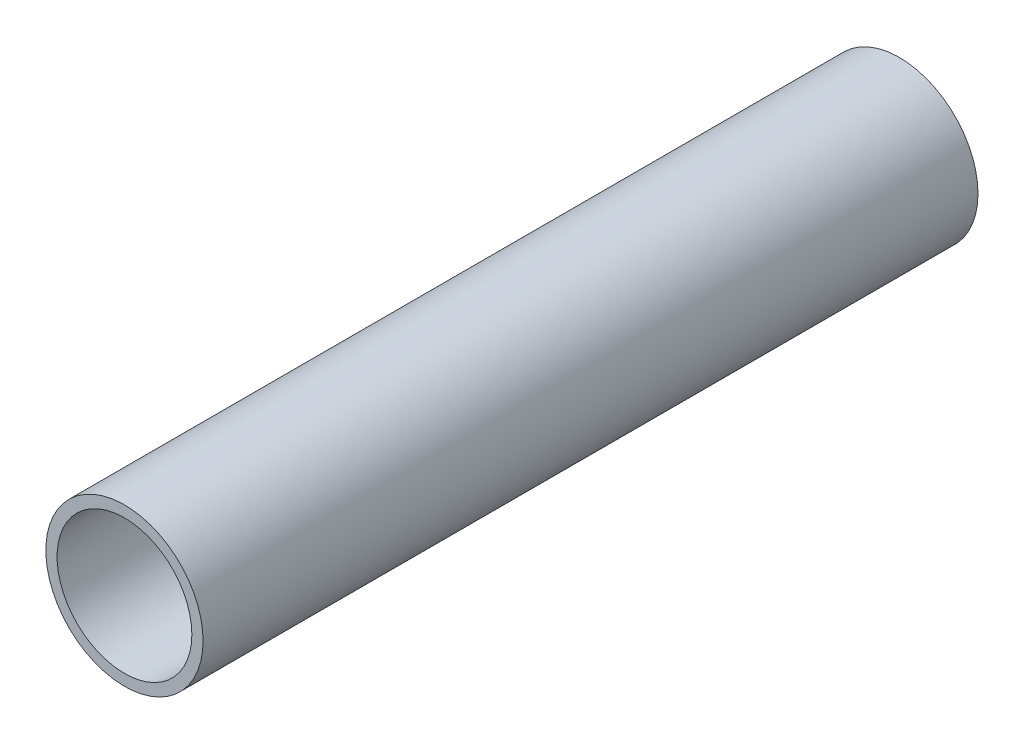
ISO-10303-21;
HEADER;
FILE_DESCRIPTION(('STEP AP214'),'2;1');
FILE_NAME('part.step','',(''),(''),'','','');
FILE_SCHEMA(('AUTOMOTIVE_DESIGN { 1 0 10303 214 1 1 1 1 }'));
ENDSEC;
DATA;
#1=APPLICATION_CONTEXT('core data for automotive mechanical design processes');
#2=APPLICATION_PROTOCOL_DEFINITION('international standard','automotive_design',2000,#1);
#3=PRODUCT_CONTEXT('',#1,'mechanical');
#4=PRODUCT('Part','Part','',(#3));
#5=PRODUCT_RELATED_PRODUCT_CATEGORY('part','',(#4));
#6=PRODUCT_DEFINITION_FORMATION('','',#4);
#7=PRODUCT_DEFINITION_CONTEXT('part definition',#1,'design');
#8=PRODUCT_DEFINITION('design','',#6,#7);
#9=PRODUCT_DEFINITION_SHAPE('','',#8);
#10=(LENGTH_UNIT() NAMED_UNIT(*) SI_UNIT(.MILLI.,.METRE.));
#11=(NAMED_UNIT(*) PLANE_ANGLE_UNIT() SI_UNIT($,.RADIAN.));
#12=(NAMED_UNIT(*) SI_UNIT($,.STERADIAN.) SOLID_ANGLE_UNIT());
#13=UNCERTAINTY_MEASURE_WITH_UNIT(LENGTH_MEASURE(1.E-05),#10,'distance_accuracy_value','');
#14=(GEOMETRIC_REPRESENTATION_CONTEXT(3) GLOBAL_UNCERTAINTY_ASSIGNED_CONTEXT((#13)) GLOBAL_UNIT_ASSIGNED_CONTEXT((#10,
#11,#12)) REPRESENTATION_CONTEXT('',''));
#15=CARTESIAN_POINT('',(0.,0.,0.));
#16=DIRECTION('',(0.,0.,1.));
#17=DIRECTION('',(1.,0.,0.));
#18=AXIS2_PLACEMENT_3D('',#15,#16,#17);
#19=CARTESIAN_POINT('',(0.,0.,69.));
#20=DIRECTION('',(0.,0.,1.));
#21=DIRECTION('',(1.,0.,0.));
#22=AXIS2_PLACEMENT_3D('',#19,#20,#21);
#23=PLANE('',#22);
#24=CARTESIAN_POINT('',(0.,0.,69.));
#25=DIRECTION('',(0.,0.,1.));
#26=DIRECTION('',(1.,0.,0.));
#27=AXIS2_PLACEMENT_3D('',#24,#25,#26);
#28=CIRCLE('',#27,7.);
#29=CARTESIAN_POINT('',(7.,0.,69.));
#30=VERTEX_POINT('',#29);
#31=EDGE_CURVE('E10',#30,#30,#28,.T.);
#32=ORIENTED_EDGE('',*,*,#31,.T.);
#33=EDGE_LOOP('',(#32));
#34=FACE_BOUND('',#33,.T.);
#35=CARTESIAN_POINT('',(0.,0.,69.));
#36=DIRECTION('',(0.,0.,1.));
#37=DIRECTION('',(1.,0.,0.));
#38=AXIS2_PLACEMENT_3D('',#35,#36,#37);
#39=CIRCLE('',#38,6.);
#40=CARTESIAN_POINT('',(6.,0.,69.));
#41=VERTEX_POINT('',#40);
#42=EDGE_CURVE('E35',#41,#41,#39,.T.);
#43=ORIENTED_EDGE('',*,*,#42,.F.);
#44=EDGE_LOOP('',(#43));
#45=FACE_BOUND('',#44,.T.);
#46=ADVANCED_FACE('F24',(#34,#45),#23,.T.);
#47=CARTESIAN_POINT('',(0.,0.,0.));
#48=DIRECTION('',(0.,0.,1.));
#49=DIRECTION('',(1.,0.,0.));
#50=AXIS2_PLACEMENT_3D('',#47,#48,#49);
#51=PLANE('',#50);
#52=CARTESIAN_POINT('',(0.,0.,0.));
#53=DIRECTION('',(0.,0.,1.));
#54=DIRECTION('',(1.,0.,0.));
#55=AXIS2_PLACEMENT_3D('',#52,#53,#54);
#56=CIRCLE('',#55,7.);
#57=CARTESIAN_POINT('',(7.,0.,0.));
#58=VERTEX_POINT('',#57);
#59=EDGE_CURVE('E31',#58,#58,#56,.T.);
#60=ORIENTED_EDGE('',*,*,#59,.F.);
#61=EDGE_LOOP('',(#60));
#62=FACE_BOUND('',#61,.T.);
#63=CARTESIAN_POINT('',(0.,0.,0.));
#64=DIRECTION('',(0.,0.,1.));
#65=DIRECTION('',(1.,0.,0.));
#66=AXIS2_PLACEMENT_3D('',#63,#64,#65);
#67=CIRCLE('',#66,6.);
#68=CARTESIAN_POINT('',(6.,0.,0.));
#69=VERTEX_POINT('',#68);
#70=EDGE_CURVE('E39',#69,#69,#67,.T.);
#71=ORIENTED_EDGE('',*,*,#70,.T.);
#72=EDGE_LOOP('',(#71));
#73=FACE_BOUND('',#72,.T.);
#74=ADVANCED_FACE('F45',(#62,#73),#51,.F.);
#75=CARTESIAN_POINT('',(0.,0.,69.));
#76=DIRECTION('',(0.,0.,-1.));
#77=DIRECTION('',(-1.,0.,0.));
#78=AXIS2_PLACEMENT_3D('',#75,#76,#77);
#79=CYLINDRICAL_SURFACE('',#78,7.);
#80=ORIENTED_EDGE('',*,*,#31,.F.);
#81=EDGE_LOOP('',(#80));
#82=FACE_BOUND('',#81,.T.);
#83=ORIENTED_EDGE('',*,*,#59,.T.);
#84=EDGE_LOOP('',(#83));
#85=FACE_BOUND('',#84,.T.);
#86=ADVANCED_FACE('F26',(#82,#85),#79,.T.);
#87=CARTESIAN_POINT('',(0.,0.,69.));
#88=DIRECTION('',(0.,0.,-1.));
#89=DIRECTION('',(-1.,0.,0.));
#90=AXIS2_PLACEMENT_3D('',#87,#88,#89);
#91=CYLINDRICAL_SURFACE('',#90,6.);
#92=ORIENTED_EDGE('',*,*,#42,.T.);
#93=EDGE_LOOP('',(#92));
#94=FACE_BOUND('',#93,.T.);
#95=ORIENTED_EDGE('',*,*,#70,.F.);
#96=EDGE_LOOP('',(#95));
#97=FACE_BOUND('',#96,.T.);
#98=ADVANCED_FACE('F47',(#94,#97),#91,.F.);
#99=CLOSED_SHELL('',(#46,#74,#86,#98));
#100=MANIFOLD_SOLID_BREP('B2',#99);
#101=ADVANCED_BREP_SHAPE_REPRESENTATION('',(#18,#100),#14);
#102=SHAPE_DEFINITION_REPRESENTATION(#9,#101);
ENDSEC;
END-ISO-10303-21;
